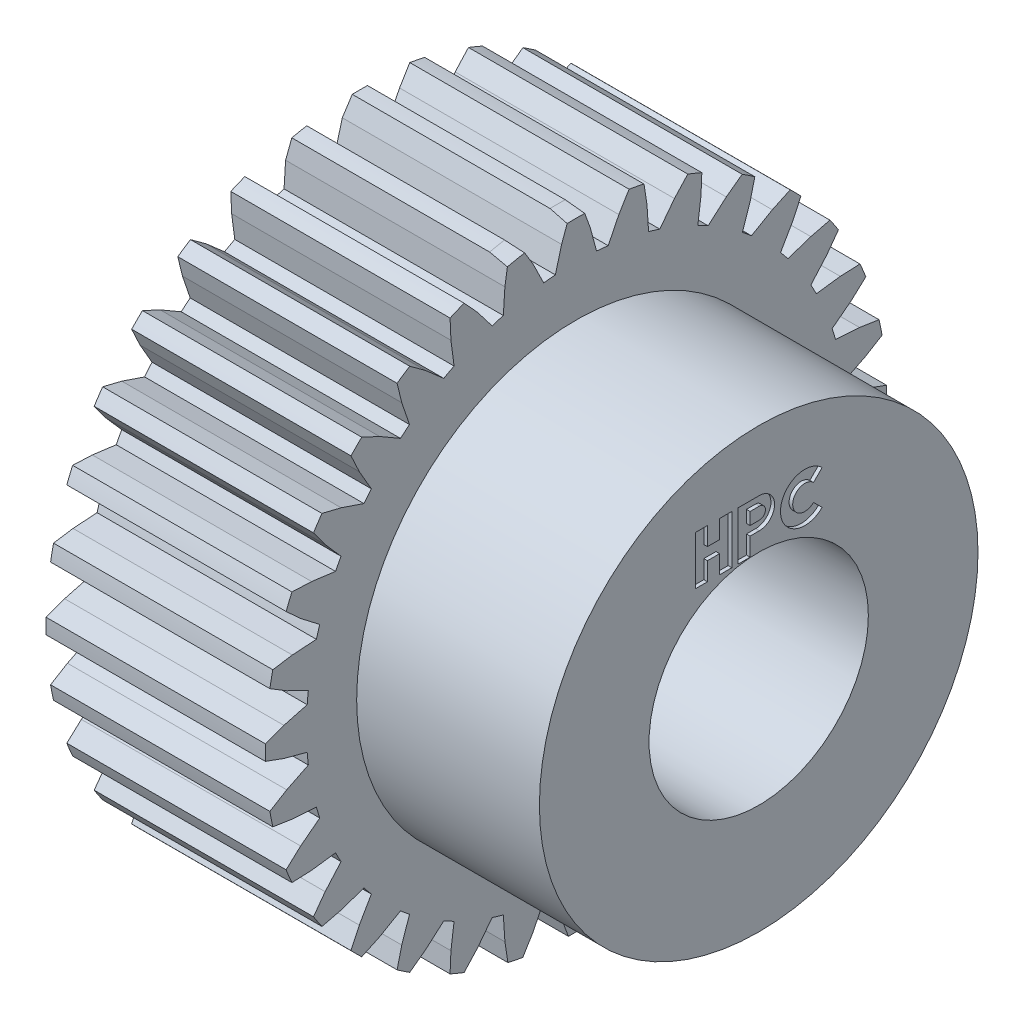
from build123d import *
from OCP.BRepFilletAPI import BRepFilletAPI_MakeChamfer

# Parameters (mm, degrees)
BOSS_EXTRU_1_DEPTH            = 6
ESQUISSE3_R                   = 6
BOSS_EXTRU_2_DEPTH            = 5.000000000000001
ENL_V_MAT_EXTRU_2_DEPTH       = 0.10000000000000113
BOSS_EXTRU_3_DEPTH            = 0.10000000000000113
ENL_V_MAT_EXTRU_3_DEPTH       = 0.10000000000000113
ENL_V_MAT_EXTRU_4_DEPTH       = 0.10000000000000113
DIAM_TRE_DU_PER_AGE_6_0_6_1_D = 6
CHANFREIN1_SIZE               = 0.5000000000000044
CHANFREIN1_SIZE2              = 0.08816349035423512


with BuildPart() as part:
    # Esquisse1 → Boss.-Extru.1 (new body)
    with BuildSketch(Plane(origin=(0, 0, 0), x_dir=(0, -1, 0), z_dir=(-1, 0, 0))):
        with BuildLine():
            Line((-7.930269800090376, 3.0595458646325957), (-7.532405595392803, 2.6949704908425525))
            Line((-7.532405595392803, 2.6949704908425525), (-7.009290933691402, 2.2935704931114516))
            ThreePointArc((-7.009290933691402, 2.2935704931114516), (-7.05743497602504, 2.1408494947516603), (-7.10225190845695, 1.9871192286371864))
            Line((-7.10225190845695, 1.9871192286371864), (-7.760211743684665, 1.9439942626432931))
            Line((-7.760211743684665, 1.9439942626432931), (-8.293570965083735, 1.8619024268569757))
            ThreePointArc((-8.293570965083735, 1.8619024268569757), (-8.336674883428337, 1.6582677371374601), (-8.374779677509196, 1.4536386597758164))
            Line((-8.374779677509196, 1.4536386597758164), (-7.91343519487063, 1.1736879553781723))
            Line((-7.91343519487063, 1.1736879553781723), (-7.322062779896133, 0.8820553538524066))
            ThreePointArc((-7.322062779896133, 0.8820553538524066), (-7.339487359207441, 0.7228764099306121), (-7.35345185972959, 0.5633566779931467))
            Line((-7.35345185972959, 0.5633566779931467), (-7.990355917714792, 0.39269875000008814))
            Line((-7.990355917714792, 0.39269875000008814), (-8.49745146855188, 0.2081310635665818))
            ThreePointArc((-8.49745146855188, 0.2081310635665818), (-8.500000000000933, 1.8978e-13), (-8.49745146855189, -0.20813106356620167))
            Line((-8.49745146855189, -0.20813106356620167), (-7.990355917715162, -0.39269874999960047))
            Line((-7.990355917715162, -0.39269874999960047), (-7.353451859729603, -0.563356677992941))
            ThreePointArc((-7.353451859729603, -0.563356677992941), (-7.339487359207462, -0.7228764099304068), (-7.322062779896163, -0.8820553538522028))
            Line((-7.322062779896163, -0.8820553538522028), (-7.913435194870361, -1.1736879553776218))
            Line((-7.913435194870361, -1.1736879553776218), (-8.37477967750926, -1.4536386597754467))
            ThreePointArc((-8.37477967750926, -1.4536386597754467), (-8.33667488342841, -1.65826773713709), (-8.293570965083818, -1.8619024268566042))
            Line((-8.293570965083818, -1.8619024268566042), (-7.760211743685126, -1.9439942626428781))
            Line((-7.760211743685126, -1.9439942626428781), (-7.1022519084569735, -1.987119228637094))
            ThreePointArc((-7.1022519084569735, -1.987119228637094), (-7.057434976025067, -2.140849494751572), (-7.009290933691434, -2.293570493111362))
            Line((-7.009290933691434, -2.293570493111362), (-7.5324055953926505, -2.694970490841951))
            Line((-7.5324055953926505, -2.694970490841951), (-7.930269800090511, -3.05954586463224))
            ThreePointArc((-7.930269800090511, -3.05954586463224), (-7.85297602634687, -3.2528091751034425), (-7.7709731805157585, -3.444121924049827))
            Line((-7.7709731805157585, -3.444121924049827), (-7.231846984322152, -3.4205831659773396))
            Line((-7.231846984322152, -3.4205831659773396), (-6.578116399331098, -3.3345179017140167))
            ThreePointArc((-6.578116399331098, -3.3345179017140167), (-6.504169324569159, -3.4765509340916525), (-6.427155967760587, -3.616945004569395))
            Line((-6.427155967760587, -3.616945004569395), (-6.861909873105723, -4.112686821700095))
            Line((-6.861909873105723, -4.112686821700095), (-7.181004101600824, -4.547876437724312))
            ThreePointArc((-7.181004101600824, -4.547876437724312), (-7.067491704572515, -4.722346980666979), (-6.949741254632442, -4.893985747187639))
            Line((-6.949741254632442, -4.893985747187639), (-6.42556640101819, -4.765720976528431))
            Line((-6.42556640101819, -4.765720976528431), (-5.801187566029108, -4.553772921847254))
            ThreePointArc((-5.801187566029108, -4.553772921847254), (-5.700952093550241, -4.678650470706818), (-5.598029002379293, -4.801322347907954))
            Line((-5.598029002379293, -4.801322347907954), (-5.927714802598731, -5.372354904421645))
            Line((-5.927714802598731, -5.372354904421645), (-6.155776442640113, -5.8614346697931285))
            ThreePointArc((-6.155776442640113, -5.8614346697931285), (-6.010407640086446, -6.01040764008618), (-5.861434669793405, -6.155776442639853))
            Line((-5.861434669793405, -6.155776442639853), (-5.372354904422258, -5.927714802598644))
            Line((-5.372354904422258, -5.927714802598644), (-4.801322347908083, -5.598029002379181))
            ThreePointArc((-4.801322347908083, -5.598029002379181), (-4.678650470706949, -5.700952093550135), (-4.553772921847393, -5.8011875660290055))
            Line((-4.553772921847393, -5.8011875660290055), (-4.765720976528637, -6.4255664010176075))
            Line((-4.765720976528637, -6.4255664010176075), (-4.893985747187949, -6.949741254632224))
            ThreePointArc((-4.893985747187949, -6.949741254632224), (-4.722346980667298, -7.067491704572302), (-4.547876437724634, -7.181004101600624))
            Line((-4.547876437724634, -7.181004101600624), (-4.112686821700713, -6.8619098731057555))
            Line((-4.112686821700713, -6.8619098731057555), (-3.6169450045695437, -6.427155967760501))
            ThreePointArc((-3.6169450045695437, -6.427155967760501), (-3.476550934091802, -6.504169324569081), (-3.3345179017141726, -6.578116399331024))
            Line((-3.3345179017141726, -6.578116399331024), (-3.4205831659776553, -7.23184698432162))
            Line((-3.4205831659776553, -7.23184698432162), (-3.444121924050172, -7.770973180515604))
            ThreePointArc((-3.444121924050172, -7.770973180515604), (-3.2528091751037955, -7.8529760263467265), (-3.0595458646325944, -7.930269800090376))
            Line((-3.0595458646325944, -7.930269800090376), (-2.694970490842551, -7.532405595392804))
            Line((-2.694970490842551, -7.532405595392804), (-2.293570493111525, -7.0092909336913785))
            ThreePointArc((-2.293570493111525, -7.0092909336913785), (-2.140849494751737, -7.057434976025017), (-1.987119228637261, -7.10225190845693))
            Line((-1.987119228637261, -7.10225190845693), (-1.9439942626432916, -7.760211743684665))
            Line((-1.9439942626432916, -7.760211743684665), (-1.8619024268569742, -8.293570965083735))
            ThreePointArc((-1.8619024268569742, -8.293570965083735), (-1.6582677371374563, -8.336674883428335), (-1.4536386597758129, -8.374779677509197))
            Line((-1.4536386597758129, -8.374779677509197), (-1.173687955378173, -7.91343519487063))
            Line((-1.173687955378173, -7.91343519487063), (-0.8820553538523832, -7.322062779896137))
            ThreePointArc((-0.8820553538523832, -7.322062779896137), (-0.722876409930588, -7.339487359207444), (-0.563356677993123, -7.353451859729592))
            Line((-0.563356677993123, -7.353451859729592), (-0.3926987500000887, -7.990355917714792))
            Line((-0.3926987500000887, -7.990355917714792), (-0.2081310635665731, -8.497451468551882))
            ThreePointArc((-0.2081310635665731, -8.497451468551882), (-1.8633e-13, -8.500000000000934), (0.20813106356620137, -8.49745146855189))
            Line((0.20813106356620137, -8.49745146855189), (0.3926987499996, -7.990355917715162))
            Line((0.3926987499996, -7.990355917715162), (0.5633566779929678, -7.353451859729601))
            ThreePointArc((0.5633566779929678, -7.353451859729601), (0.7228764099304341, -7.339487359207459), (0.8820553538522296, -7.322062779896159))
            Line((0.8820553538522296, -7.322062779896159), (1.1736879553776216, -7.913435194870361))
            Line((1.1736879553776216, -7.913435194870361), (1.4536386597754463, -8.37477967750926))
            ThreePointArc((1.4536386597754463, -8.37477967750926), (1.6582677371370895, -8.33667488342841), (1.8619024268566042, -8.293570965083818))
            Line((1.8619024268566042, -8.293570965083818), (1.9439942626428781, -7.760211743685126))
            Line((1.9439942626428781, -7.760211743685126), (1.9871192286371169, -7.102251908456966))
            ThreePointArc((1.9871192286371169, -7.102251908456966), (2.1408494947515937, -7.05743497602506), (2.293570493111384, -7.009290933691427))
            Line((2.293570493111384, -7.009290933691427), (2.694970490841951, -7.5324055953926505))
            Line((2.694970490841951, -7.5324055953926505), (3.05954586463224, -7.930269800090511))
            ThreePointArc((3.05954586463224, -7.930269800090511), (3.252809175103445, -7.8529760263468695), (3.4441219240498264, -7.770973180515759))
            Line((3.4441219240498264, -7.770973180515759), (3.4205831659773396, -7.231846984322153))
            Line((3.4205831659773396, -7.231846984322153), (3.33451790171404, -6.578116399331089))
            ThreePointArc((3.33451790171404, -6.578116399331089), (3.4765509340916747, -6.50416932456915), (3.6169450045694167, -6.427155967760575))
            Line((3.6169450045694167, -6.427155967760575), (4.112686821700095, -6.8619098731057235))
            Line((4.112686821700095, -6.8619098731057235), (4.547876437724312, -7.181004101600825))
            ThreePointArc((4.547876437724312, -7.181004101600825), (4.7223469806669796, -7.0674917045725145), (4.893985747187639, -6.9497412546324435))
            Line((4.893985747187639, -6.9497412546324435), (4.765720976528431, -6.425566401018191))
            Line((4.765720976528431, -6.425566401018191), (4.553772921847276, -5.8011875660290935))
            ThreePointArc((4.553772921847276, -5.8011875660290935), (4.678650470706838, -5.700952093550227), (4.801322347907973, -5.5980290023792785))
            Line((4.801322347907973, -5.5980290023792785), (5.372354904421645, -5.927714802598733))
            Line((5.372354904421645, -5.927714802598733), (5.8614346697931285, -6.155776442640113))
            ThreePointArc((5.8614346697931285, -6.155776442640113), (6.0104076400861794, -6.010407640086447), (6.155776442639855, -5.861434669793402))
            Line((6.155776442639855, -5.861434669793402), (5.927714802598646, -5.372354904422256))
            Line((5.927714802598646, -5.372354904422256), (5.598029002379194, -4.801322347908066))
            ThreePointArc((5.598029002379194, -4.801322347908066), (5.700952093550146, -4.678650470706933), (5.801187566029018, -4.553772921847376))
            Line((5.801187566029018, -4.553772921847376), (6.425566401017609, -4.765720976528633))
            Line((6.425566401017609, -4.765720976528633), (6.949741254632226, -4.893985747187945))
            ThreePointArc((6.949741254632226, -4.893985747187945), (7.067491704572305, -4.722346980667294), (7.181004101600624, -4.547876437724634))
            Line((7.181004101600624, -4.547876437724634), (6.8619098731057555, -4.112686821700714))
            Line((6.8619098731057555, -4.112686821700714), (6.427155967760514, -3.616945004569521))
            ThreePointArc((6.427155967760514, -3.616945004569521), (6.504169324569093, -3.476550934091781), (6.578116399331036, -3.334517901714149))
            Line((6.578116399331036, -3.334517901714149), (7.23184698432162, -3.4205831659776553))
            Line((7.23184698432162, -3.4205831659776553), (7.770973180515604, -3.4441219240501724))
            ThreePointArc((7.770973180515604, -3.4441219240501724), (7.8529760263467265, -3.2528091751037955), (7.930269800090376, -3.059545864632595))
            Line((7.930269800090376, -3.059545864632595), (7.532405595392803, -2.6949704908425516))
            Line((7.532405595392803, -2.6949704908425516), (7.0092909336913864, -2.2935704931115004))
            ThreePointArc((7.0092909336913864, -2.2935704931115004), (7.057434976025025, -2.140849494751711), (7.102251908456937, -1.9871192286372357))
            Line((7.102251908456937, -1.9871192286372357), (7.760211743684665, -1.9439942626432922))
            Line((7.760211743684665, -1.9439942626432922), (8.293570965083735, -1.8619024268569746))
            ThreePointArc((8.293570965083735, -1.8619024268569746), (8.336674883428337, -1.6582677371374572), (8.374779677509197, -1.4536386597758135))
            Line((8.374779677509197, -1.4536386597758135), (7.91343519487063, -1.1736879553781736))
            Line((7.91343519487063, -1.1736879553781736), (7.32206277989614, -0.8820553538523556))
            ThreePointArc((7.32206277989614, -0.8820553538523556), (7.339487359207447, -0.7228764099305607), (7.353451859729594, -0.5633566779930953))
            Line((7.353451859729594, -0.5633566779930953), (7.990355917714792, -0.39269875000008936))
            Line((7.990355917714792, -0.39269875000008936), (8.497451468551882, -0.20813106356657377))
            ThreePointArc((8.497451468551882, -0.20813106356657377), (8.500000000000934, -1.8821e-13), (8.49745146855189, 0.20813106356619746))
            Line((8.49745146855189, 0.20813106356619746), (7.990355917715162, 0.3926987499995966))
            Line((7.990355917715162, 0.3926987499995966), (7.353451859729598, 0.5633566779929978))
            ThreePointArc((7.353451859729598, 0.5633566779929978), (7.339487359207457, 0.7228764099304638), (7.322062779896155, 0.882055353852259))
            Line((7.322062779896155, 0.882055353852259), (7.913435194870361, 1.1736879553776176))
            Line((7.913435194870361, 1.1736879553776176), (8.374779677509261, 1.4536386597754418))
            ThreePointArc((8.374779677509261, 1.4536386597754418), (8.336674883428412, 1.658267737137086), (8.29357096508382, 1.8619024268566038))
            Line((8.29357096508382, 1.8619024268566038), (7.760211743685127, 1.9439942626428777))
            Line((7.760211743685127, 1.9439942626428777), (7.1022519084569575, 1.9871192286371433))
            ThreePointArc((7.1022519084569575, 1.9871192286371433), (7.057434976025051, 2.1408494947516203), (7.0092909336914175, 2.293570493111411))
            Line((7.0092909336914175, 2.293570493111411), (7.532405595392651, 2.694970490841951))
            Line((7.532405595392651, 2.694970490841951), (7.930269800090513, 3.05954586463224))
            ThreePointArc((7.930269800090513, 3.05954586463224), (7.852976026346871, 3.2528091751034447), (7.7709731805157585, 3.4441219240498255))
            Line((7.7709731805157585, 3.4441219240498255), (7.231846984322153, 3.4205831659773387))
            Line((7.231846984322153, 3.4205831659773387), (6.578116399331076, 3.3345179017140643))
            ThreePointArc((6.578116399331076, 3.3345179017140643), (6.504169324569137, 3.476550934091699), (6.427155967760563, 3.616945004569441))
            Line((6.427155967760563, 3.616945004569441), (6.861909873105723, 4.112686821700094))
            Line((6.861909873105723, 4.112686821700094), (7.181004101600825, 4.5478764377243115))
            ThreePointArc((7.181004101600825, 4.5478764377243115), (7.0674917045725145, 4.7223469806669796), (6.9497412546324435, 4.893985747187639))
            Line((6.9497412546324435, 4.893985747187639), (6.425566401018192, 4.7657209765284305))
            Line((6.425566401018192, 4.7657209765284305), (5.801187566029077, 4.553772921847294))
            ThreePointArc((5.801187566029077, 4.553772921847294), (5.70095209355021, 4.678650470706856), (5.598029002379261, 4.801322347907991))
            Line((5.598029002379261, 4.801322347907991), (5.927714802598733, 5.372354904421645))
            Line((5.927714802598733, 5.372354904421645), (6.155776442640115, 5.8614346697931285))
            ThreePointArc((6.155776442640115, 5.8614346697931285), (6.010407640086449, 6.010407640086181), (5.861434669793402, 6.155776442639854))
            Line((5.861434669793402, 6.155776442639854), (5.372354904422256, 5.927714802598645))
            Line((5.372354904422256, 5.927714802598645), (4.8013223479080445, 5.59802900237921))
            ThreePointArc((4.8013223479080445, 5.59802900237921), (4.678650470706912, 5.700952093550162), (4.553772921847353, 5.801187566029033))
            Line((4.553772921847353, 5.801187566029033), (4.765720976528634, 6.425566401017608))
            Line((4.765720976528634, 6.425566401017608), (4.893985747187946, 6.949741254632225))
            ThreePointArc((4.893985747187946, 6.949741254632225), (4.722346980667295, 7.067491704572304), (4.547876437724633, 7.181004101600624))
            Line((4.547876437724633, 7.181004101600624), (4.112686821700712, 6.861909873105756))
            Line((4.112686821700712, 6.861909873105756), (3.6169450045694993, 6.427155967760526))
            ThreePointArc((3.6169450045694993, 6.427155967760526), (3.4765509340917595, 6.504169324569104), (3.334517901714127, 6.578116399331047))
            Line((3.334517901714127, 6.578116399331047), (3.4205831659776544, 7.23184698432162))
            Line((3.4205831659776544, 7.23184698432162), (3.444121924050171, 7.770973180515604))
            ThreePointArc((3.444121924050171, 7.770973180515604), (3.2528091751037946, 7.8529760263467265), (3.0595458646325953, 7.930269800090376))
            Line((3.0595458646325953, 7.930269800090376), (2.694970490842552, 7.532405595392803))
            Line((2.694970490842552, 7.532405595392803), (2.2935704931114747, 7.009290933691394))
            ThreePointArc((2.2935704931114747, 7.009290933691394), (2.1408494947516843, 7.057434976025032), (1.9871192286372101, 7.102251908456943))
            Line((1.9871192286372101, 7.102251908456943), (1.9439942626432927, 7.760211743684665))
            Line((1.9439942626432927, 7.760211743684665), (1.8619024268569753, 8.293570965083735))
            ThreePointArc((1.8619024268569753, 8.293570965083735), (1.6582677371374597, 8.336674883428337), (1.4536386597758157, 8.374779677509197))
            Line((1.4536386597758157, 8.374779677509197), (1.1736879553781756, 7.91343519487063))
            Line((1.1736879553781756, 7.91343519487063), (0.8820553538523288, 7.322062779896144))
            ThreePointArc((0.8820553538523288, 7.322062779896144), (0.7228764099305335, 7.33948735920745), (0.5633566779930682, 7.353451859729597))
            Line((0.5633566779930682, 7.353451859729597), (0.3926987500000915, 7.990355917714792))
            Line((0.3926987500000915, 7.990355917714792), (0.20813106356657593, 8.497451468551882))
            ThreePointArc((0.20813106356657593, 8.497451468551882), (1.8926e-13, 8.500000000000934), (-0.20813106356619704, 8.49745146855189))
            Line((-0.20813106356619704, 8.49745146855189), (-0.39269874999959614, 7.990355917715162))
            Line((-0.39269874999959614, 7.990355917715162), (-0.5633566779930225, 7.353451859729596))
            ThreePointArc((-0.5633566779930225, 7.353451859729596), (-0.7228764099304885, 7.339487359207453), (-0.8820553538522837, 7.322062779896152))
            Line((-0.8820553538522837, 7.322062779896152), (-1.1736879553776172, 7.913435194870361))
            Line((-1.1736879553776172, 7.913435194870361), (-1.4536386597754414, 8.374779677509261))
            ThreePointArc((-1.4536386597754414, 8.374779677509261), (-1.6582677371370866, 8.33667488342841), (-1.8619024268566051, 8.29357096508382))
            Line((-1.8619024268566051, 8.29357096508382), (-1.943994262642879, 7.760211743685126))
            Line((-1.943994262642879, 7.760211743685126), (-1.987119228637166, 7.102251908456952))
            ThreePointArc((-1.987119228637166, 7.102251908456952), (-2.1408494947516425, 7.0574349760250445), (-2.293570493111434, 7.009290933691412))
            Line((-2.293570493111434, 7.009290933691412), (-2.694970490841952, 7.5324055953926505))
            Line((-2.694970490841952, 7.5324055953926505), (-3.059545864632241, 7.930269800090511))
            ThreePointArc((-3.059545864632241, 7.930269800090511), (-3.252809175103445, 7.852976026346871), (-3.4441219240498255, 7.7709731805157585))
            Line((-3.4441219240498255, 7.7709731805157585), (-3.4205831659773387, 7.231846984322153))
            Line((-3.4205831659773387, 7.231846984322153), (-3.334517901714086, 6.578116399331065))
            ThreePointArc((-3.334517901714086, 6.578116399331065), (-3.4765509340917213, 6.5041693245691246), (-3.6169450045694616, 6.427155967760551))
            Line((-3.6169450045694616, 6.427155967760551), (-4.112686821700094, 6.861909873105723))
            Line((-4.112686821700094, 6.861909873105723), (-4.5478764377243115, 7.181004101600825))
            ThreePointArc((-4.5478764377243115, 7.181004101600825), (-4.722346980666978, 7.067491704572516), (-4.893985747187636, 6.9497412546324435))
            Line((-4.893985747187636, 6.9497412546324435), (-4.765720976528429, 6.425566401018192))
            Line((-4.765720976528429, 6.425566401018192), (-4.553772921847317, 5.80118756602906))
            ThreePointArc((-4.553772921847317, 5.80118756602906), (-4.678650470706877, 5.7009520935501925), (-4.801322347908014, 5.598029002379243))
            Line((-4.801322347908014, 5.598029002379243), (-5.372354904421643, 5.927714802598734))
            Line((-5.372354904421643, 5.927714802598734), (-5.861434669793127, 6.155776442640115))
            ThreePointArc((-5.861434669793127, 6.155776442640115), (-6.0104076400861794, 6.010407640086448), (-6.155776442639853, 5.861434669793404))
            Line((-6.155776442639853, 5.861434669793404), (-5.927714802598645, 5.372354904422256))
            Line((-5.927714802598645, 5.372354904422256), (-5.598029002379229, 4.801322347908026))
            ThreePointArc((-5.598029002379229, 4.801322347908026), (-5.70095209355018, 4.678650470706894), (-5.801187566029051, 4.553772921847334))
            Line((-5.801187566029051, 4.553772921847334), (-6.4255664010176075, 4.765720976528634))
            Line((-6.4255664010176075, 4.765720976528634), (-6.949741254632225, 4.893985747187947))
            ThreePointArc((-6.949741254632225, 4.893985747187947), (-7.067491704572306, 4.722346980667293), (-7.181004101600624, 4.547876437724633))
            Line((-7.181004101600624, 4.547876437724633), (-6.861909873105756, 4.112686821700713))
            Line((-6.861909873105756, 4.112686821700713), (-6.427155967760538, 3.6169450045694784))
            ThreePointArc((-6.427155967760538, 3.6169450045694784), (-6.504169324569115, 3.47655093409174), (-6.578116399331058, 3.3345179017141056))
            Line((-6.578116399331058, 3.3345179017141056), (-7.23184698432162, 3.4205831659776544))
            Line((-7.23184698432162, 3.4205831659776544), (-7.770973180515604, 3.444121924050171))
            ThreePointArc((-7.770973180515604, 3.444121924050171), (-7.8529760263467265, 3.252809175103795), (-7.930269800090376, 3.0595458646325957))
        make_face()
    extrude(amount=-BOSS_EXTRU_1_DEPTH)

    # Esquisse3 → Boss.-Extru.2 (add)
    with BuildSketch(Plane(origin=(6, 0, 0), x_dir=(0, 0, -1), z_dir=(1, 0, 0))):
        with Locations(Location((0, 0, 0), (0, 0, 180))):
            Circle(ESQUISSE3_R)
    extrude(amount=BOSS_EXTRU_2_DEPTH)

    # Esquisse4 → Enl_v. mat.-Extru.2 (cut)
    with BuildSketch(Plane(origin=(11.000000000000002, 0, 0), x_dir=(0, 0, -1), z_dir=(1, 0, 0))):
        with BuildLine():
            Line((-0.235702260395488, 3), (-0.235702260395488, 3.49999999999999))
            Line((-0.235702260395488, 3.49999999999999), (0.0177075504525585, 3.4999999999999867))
            ThreePointArc((0.0177075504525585, 3.4999999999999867), (0.43437421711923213, 3.9166666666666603), (0.01770755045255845, 4.333333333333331))
            Line((0.01770755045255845, 4.333333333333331), (-0.569035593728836, 4.33333333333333))
            Line((-0.569035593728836, 4.33333333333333), (-0.569035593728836, 3))
            Line((-0.569035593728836, 3), (-0.235702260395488, 3))
        make_face()
    extrude(amount=-ENL_V_MAT_EXTRU_2_DEPTH, mode=Mode.SUBTRACT)

    # Esquisse5 → Boss.-Extru.3 (add)
    with BuildSketch(Plane(origin=(10.9, 0, 0), x_dir=(0, 0, -1), z_dir=(1, 0, 0))):
        with BuildLine():
            Line((0.01770749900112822, 3.7499999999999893), (-0.23570226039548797, 3.74999999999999))
            Line((-0.23570226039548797, 3.74999999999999), (-0.23570226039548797, 4.08333333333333))
            Line((-0.23570226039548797, 4.08333333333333), (0.0177074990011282, 4.083333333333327))
            ThreePointArc((0.0177074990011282, 4.083333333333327), (0.18437416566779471, 3.9166666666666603), (0.01770749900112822, 3.7499999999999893))
        make_face()
    extrude(amount=BOSS_EXTRU_3_DEPTH)

    # Esquisse6 → Enl_v. mat.-Extru.3 (cut)
    with BuildSketch(Plane(origin=(11.000000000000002, 0, 0), x_dir=(0, 0, -1), z_dir=(1, 0, 0))):
        Polygon((-1.06832433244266, 4.333333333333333), (-1.06832433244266, 3.83333333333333), (-1.4016576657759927, 3.83333333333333), (-1.401657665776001, 4.33333333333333), (-1.73499099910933, 4.333333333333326), (-1.73499099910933, 3), (-1.4016576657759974, 3), (-1.4016576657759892, 3.5), (-1.06832433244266, 3.5), (-1.06832433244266, 2.9999999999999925), (-0.734990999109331, 2.999999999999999), (-0.734990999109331, 4.33333333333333), align=None)
    extrude(amount=-ENL_V_MAT_EXTRU_3_DEPTH, mode=Mode.SUBTRACT)

    # Esquisse7 → Enl_v. mat.-Extru.4 (cut)
    with BuildSketch(Plane(origin=(11.000000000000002, 0, 0), x_dir=(0, 0, -1), z_dir=(1, 0, 0))):
        with BuildLine():
            Line((1.7349909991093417, 3.1952621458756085), (1.4992887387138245, 3.4309644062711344))
            ThreePointArc((1.4992887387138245, 3.4309644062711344), (0.9302531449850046, 3.666666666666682), (1.4992887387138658, 3.9023689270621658))
            Line((1.4992887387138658, 3.9023689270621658), (1.7349909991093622, 4.138071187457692))
            ThreePointArc((1.7349909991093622, 4.138071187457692), (0.5969198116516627, 3.6666666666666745), (1.7349909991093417, 3.1952621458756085))
        make_face()
    extrude(amount=-ENL_V_MAT_EXTRU_4_DEPTH, mode=Mode.SUBTRACT)

    # Diam_tre du per_age _6.0 _6_1 (through all)
    with Locations(Plane(origin=(11.000000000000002, 0, 0), x_dir=(0, 0, -1), z_dir=(1, 0, 0))):
        with Locations((0, 0)):
            Hole(DIAM_TRE_DU_PER_AGE_6_0_6_1_D / 2)

    # Chanfrein1: one chamfer whose edges measure the first distance from different faces: ONE call of the kernel's chamfer builder (chamfer() names one face for all edges)
    chanfrein1_edges_1 = [part.edges().sort_by_distance(p)[0] for p in [
        (6, 8.50000000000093, 1.9007e-13),
    ]]
    chanfrein1_side_1 = [part.faces().sort_by_distance(p)[0] for p in [
        (3, 8.50000000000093, 1.9007e-13),
    ]]
    chanfrein1_edges_2 = [part.edges().sort_by_distance(p)[0] for p in [
        (6, 8.336674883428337, 1.6582677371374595),
    ]]
    chanfrein1_side_2 = [part.faces().sort_by_distance(p)[0] for p in [
        (3, 8.336674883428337, 1.6582677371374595),
    ]]
    chanfrein1_edges_3 = [part.edges().sort_by_distance(p)[0] for p in [
        (0, 8.50000000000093, 1.9007e-13),
        (0, 8.336674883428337, 1.6582677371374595),
    ]]
    chanfrein1_side_3 = [part.faces().sort_by_distance(p)[0] for p in [
        (0, -4.588778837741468, 6.867592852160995),
    ]]
    chanfrein1 = BRepFilletAPI_MakeChamfer(part.part.solid().wrapped)
    for e in chanfrein1_edges_1:
        chanfrein1.Add(CHANFREIN1_SIZE, CHANFREIN1_SIZE2, e.wrapped, chanfrein1_side_1[0].wrapped)  # the first distance lies on this face
    for e in chanfrein1_edges_2:
        chanfrein1.Add(CHANFREIN1_SIZE, CHANFREIN1_SIZE2, e.wrapped, chanfrein1_side_2[0].wrapped)  # the first distance lies on this face
    for e in chanfrein1_edges_3:
        chanfrein1.Add(CHANFREIN1_SIZE, CHANFREIN1_SIZE2, e.wrapped, chanfrein1_side_3[0].wrapped)  # the first distance lies on this face
    add(Compound.cast(chanfrein1.Shape()), mode=Mode.REPLACE)


solid = part.part
